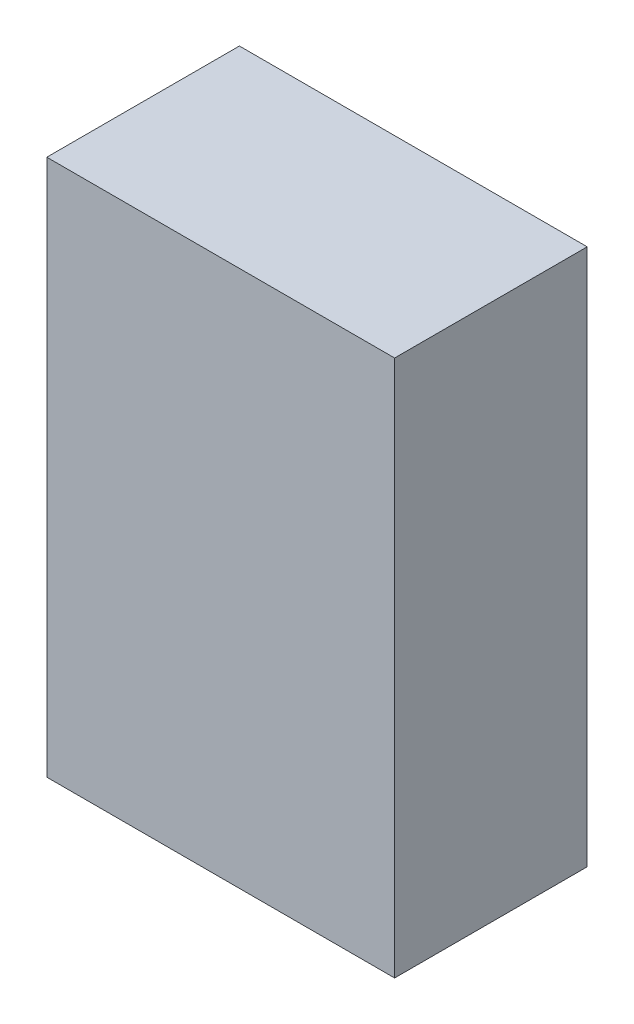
from build123d import *

# Parameters (mm, degrees)
SKETCH1_W      = 114.679619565
SKETCH1_H      = 177.04076087
EXTRUDE1_DEPTH = 63.5


with BuildPart() as part:
    # Sketch1 → Extrude1 (new body)
    with BuildSketch(Plane.XY):
        with Locations((56.960190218, 89.279619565)):
            Rectangle(SKETCH1_W, SKETCH1_H)
    extrude(amount=EXTRUDE1_DEPTH)


solid = part.part
